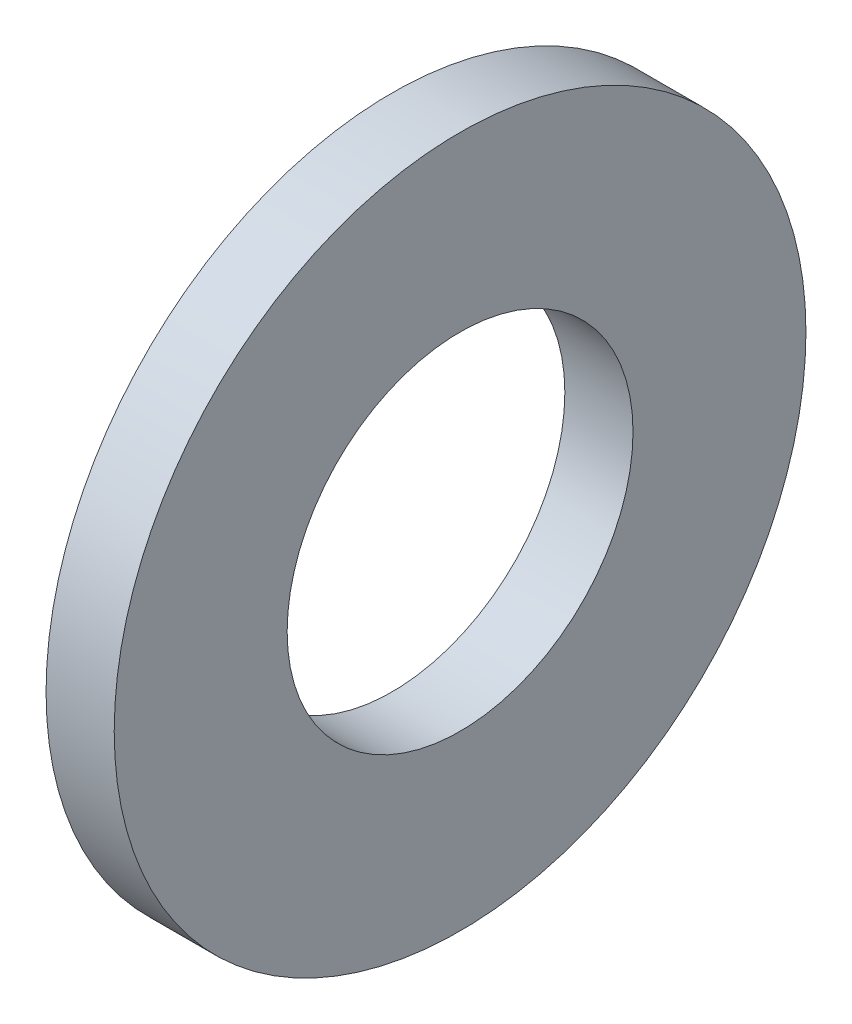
ISO-10303-21;
HEADER;
FILE_DESCRIPTION(('STEP AP214'),'2;1');
FILE_NAME('part.step','',(''),(''),'','','');
FILE_SCHEMA(('AUTOMOTIVE_DESIGN { 1 0 10303 214 1 1 1 1 }'));
ENDSEC;
DATA;
#1=APPLICATION_CONTEXT('core data for automotive mechanical design processes');
#2=APPLICATION_PROTOCOL_DEFINITION('international standard','automotive_design',2000,#1);
#3=PRODUCT_CONTEXT('',#1,'mechanical');
#4=PRODUCT('Part','Part','',(#3));
#5=PRODUCT_RELATED_PRODUCT_CATEGORY('part','',(#4));
#6=PRODUCT_DEFINITION_FORMATION('','',#4);
#7=PRODUCT_DEFINITION_CONTEXT('part definition',#1,'design');
#8=PRODUCT_DEFINITION('design','',#6,#7);
#9=PRODUCT_DEFINITION_SHAPE('','',#8);
#10=(LENGTH_UNIT() NAMED_UNIT(*) SI_UNIT(.MILLI.,.METRE.));
#11=(NAMED_UNIT(*) PLANE_ANGLE_UNIT() SI_UNIT($,.RADIAN.));
#12=(NAMED_UNIT(*) SI_UNIT($,.STERADIAN.) SOLID_ANGLE_UNIT());
#13=UNCERTAINTY_MEASURE_WITH_UNIT(LENGTH_MEASURE(1.E-05),#10,'distance_accuracy_value','');
#14=(GEOMETRIC_REPRESENTATION_CONTEXT(3) GLOBAL_UNCERTAINTY_ASSIGNED_CONTEXT((#13)) GLOBAL_UNIT_ASSIGNED_CONTEXT((#10,
#11,#12)) REPRESENTATION_CONTEXT('',''));
#15=CARTESIAN_POINT('',(0.,0.,0.));
#16=DIRECTION('',(0.,0.,1.));
#17=DIRECTION('',(1.,0.,0.));
#18=AXIS2_PLACEMENT_3D('',#15,#16,#17);
#19=CARTESIAN_POINT('',(-34.925,0.,0.));
#20=DIRECTION('',(-1.,0.,0.));
#21=DIRECTION('',(0.,0.,1.));
#22=AXIS2_PLACEMENT_3D('',#19,#20,#21);
#23=CYLINDRICAL_SURFACE('',#22,2.5781);
#24=CARTESIAN_POINT('',(0.,0.,0.));
#25=DIRECTION('',(-1.,0.,0.));
#26=DIRECTION('',(0.,0.,1.));
#27=AXIS2_PLACEMENT_3D('',#24,#25,#26);
#28=CIRCLE('',#27,2.5781);
#29=CARTESIAN_POINT('',(0.,0.,2.5781));
#30=VERTEX_POINT('',#29);
#31=EDGE_CURVE('E10',#30,#30,#28,.T.);
#32=ORIENTED_EDGE('',*,*,#31,.F.);
#33=EDGE_LOOP('',(#32));
#34=FACE_BOUND('',#33,.T.);
#35=CARTESIAN_POINT('',(-1.016,0.,0.));
#36=DIRECTION('',(-1.,0.,0.));
#37=DIRECTION('',(0.,0.,1.));
#38=AXIS2_PLACEMENT_3D('',#35,#36,#37);
#39=CIRCLE('',#38,2.5781);
#40=CARTESIAN_POINT('',(-1.016,0.,2.5781));
#41=VERTEX_POINT('',#40);
#42=EDGE_CURVE('E42',#41,#41,#39,.T.);
#43=ORIENTED_EDGE('',*,*,#42,.T.);
#44=EDGE_LOOP('',(#43));
#45=FACE_BOUND('',#44,.T.);
#46=ADVANCED_FACE('F28',(#34,#45),#23,.F.);
#47=CARTESIAN_POINT('',(0.,2.57810000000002,0.));
#48=DIRECTION('',(-1.,0.,0.));
#49=DIRECTION('',(0.,0.,1.));
#50=AXIS2_PLACEMENT_3D('',#47,#48,#49);
#51=PLANE('',#50);
#52=CARTESIAN_POINT('',(0.,0.,0.));
#53=DIRECTION('',(-1.,0.,0.));
#54=DIRECTION('',(0.,0.,1.));
#55=AXIS2_PLACEMENT_3D('',#52,#53,#54);
#56=CIRCLE('',#55,5.1562);
#57=CARTESIAN_POINT('',(0.,0.,5.1562));
#58=VERTEX_POINT('',#57);
#59=EDGE_CURVE('E34',#58,#58,#56,.T.);
#60=ORIENTED_EDGE('',*,*,#59,.F.);
#61=EDGE_LOOP('',(#60));
#62=FACE_BOUND('',#61,.T.);
#63=ORIENTED_EDGE('',*,*,#31,.T.);
#64=EDGE_LOOP('',(#63));
#65=FACE_BOUND('',#64,.T.);
#66=ADVANCED_FACE('F57',(#62,#65),#51,.F.);
#67=CARTESIAN_POINT('',(-34.925,0.,0.));
#68=DIRECTION('',(-1.,0.,0.));
#69=DIRECTION('',(0.,0.,1.));
#70=AXIS2_PLACEMENT_3D('',#67,#68,#69);
#71=CYLINDRICAL_SURFACE('',#70,5.1562);
#72=CARTESIAN_POINT('',(-1.016,0.,0.));
#73=DIRECTION('',(-1.,0.,0.));
#74=DIRECTION('',(0.,0.,1.));
#75=AXIS2_PLACEMENT_3D('',#72,#73,#74);
#76=CIRCLE('',#75,5.1562);
#77=CARTESIAN_POINT('',(-1.016,0.,5.1562));
#78=VERTEX_POINT('',#77);
#79=EDGE_CURVE('E38',#78,#78,#76,.T.);
#80=ORIENTED_EDGE('',*,*,#79,.F.);
#81=EDGE_LOOP('',(#80));
#82=FACE_BOUND('',#81,.T.);
#83=ORIENTED_EDGE('',*,*,#59,.T.);
#84=EDGE_LOOP('',(#83));
#85=FACE_BOUND('',#84,.T.);
#86=ADVANCED_FACE('F52',(#82,#85),#71,.T.);
#87=CARTESIAN_POINT('',(-1.016,5.15620000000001,0.));
#88=DIRECTION('',(1.,0.,0.));
#89=DIRECTION('',(0.,0.,-1.));
#90=AXIS2_PLACEMENT_3D('',#87,#88,#89);
#91=PLANE('',#90);
#92=ORIENTED_EDGE('',*,*,#42,.F.);
#93=EDGE_LOOP('',(#92));
#94=FACE_BOUND('',#93,.T.);
#95=ORIENTED_EDGE('',*,*,#79,.T.);
#96=EDGE_LOOP('',(#95));
#97=FACE_BOUND('',#96,.T.);
#98=ADVANCED_FACE('F49',(#94,#97),#91,.F.);
#99=CLOSED_SHELL('',(#46,#66,#86,#98));
#100=MANIFOLD_SOLID_BREP('B2',#99);
#101=ADVANCED_BREP_SHAPE_REPRESENTATION('',(#18,#100),#14);
#102=SHAPE_DEFINITION_REPRESENTATION(#9,#101);
ENDSEC;
END-ISO-10303-21;
